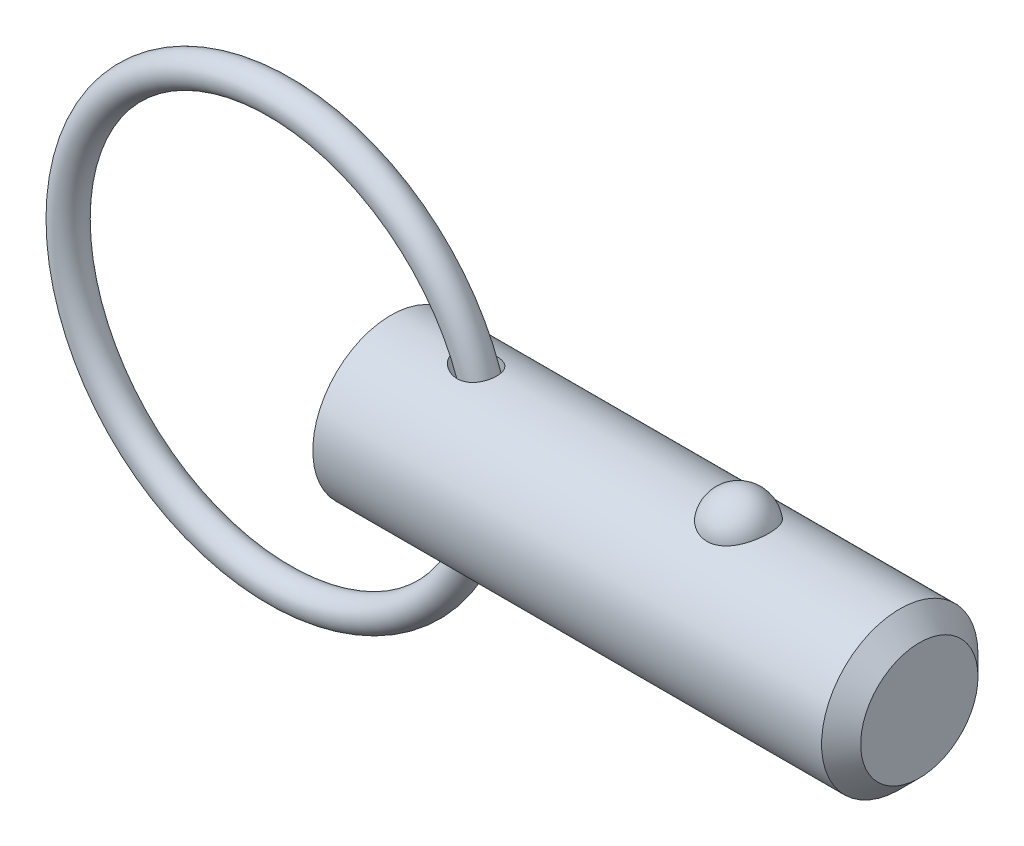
ISO-10303-21;
HEADER;
FILE_DESCRIPTION(('STEP AP214'),'2;1');
FILE_NAME('part.step','',(''),(''),'','','');
FILE_SCHEMA(('AUTOMOTIVE_DESIGN { 1 0 10303 214 1 1 1 1 }'));
ENDSEC;
DATA;
#1=APPLICATION_CONTEXT('core data for automotive mechanical design processes');
#2=APPLICATION_PROTOCOL_DEFINITION('international standard','automotive_design',2000,#1);
#3=PRODUCT_CONTEXT('',#1,'mechanical');
#4=PRODUCT('Part','Part','',(#3));
#5=PRODUCT_RELATED_PRODUCT_CATEGORY('part','',(#4));
#6=PRODUCT_DEFINITION_FORMATION('','',#4);
#7=PRODUCT_DEFINITION_CONTEXT('part definition',#1,'design');
#8=PRODUCT_DEFINITION('design','',#6,#7);
#9=PRODUCT_DEFINITION_SHAPE('','',#8);
#10=(LENGTH_UNIT() NAMED_UNIT(*) SI_UNIT(.MILLI.,.METRE.));
#11=(NAMED_UNIT(*) PLANE_ANGLE_UNIT() SI_UNIT($,.RADIAN.));
#12=(NAMED_UNIT(*) SI_UNIT($,.STERADIAN.) SOLID_ANGLE_UNIT());
#13=UNCERTAINTY_MEASURE_WITH_UNIT(LENGTH_MEASURE(1.E-05),#10,'distance_accuracy_value','');
#14=(GEOMETRIC_REPRESENTATION_CONTEXT(3) GLOBAL_UNCERTAINTY_ASSIGNED_CONTEXT((#13)) GLOBAL_UNIT_ASSIGNED_CONTEXT((#10,
#11,#12)) REPRESENTATION_CONTEXT('',''));
#15=CARTESIAN_POINT('',(0.,0.,0.));
#16=DIRECTION('',(0.,0.,1.));
#17=DIRECTION('',(1.,0.,0.));
#18=AXIS2_PLACEMENT_3D('',#15,#16,#17);
#19=CARTESIAN_POINT('',(-6.70471658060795,0.,0.));
#20=DIRECTION('',(0.,0.,1.));
#21=DIRECTION('',(1.,0.,0.));
#22=AXIS2_PLACEMENT_3D('',#19,#20,#21);
#23=TOROIDAL_SURFACE('',#22,12.7,0.940000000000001);
#24=CARTESIAN_POINT('',(6.93528341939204,0.,0.));
#25=VERTEX_POINT('',#24);
#26=VERTEX_LOOP('',#25);
#27=FACE_BOUND('',#26,.T.);
#28=ADVANCED_FACE('P0_F12',(#27),#23,.T.);
#29=CLOSED_SHELL('',(#28));
#30=MANIFOLD_SOLID_BREP('P0_B1',#29);
#31=CARTESIAN_POINT('',(0.,0.,0.));
#32=DIRECTION('',(1.,0.,0.));
#33=DIRECTION('',(0.,0.,-1.));
#34=AXIS2_PLACEMENT_3D('',#31,#32,#33);
#35=CYLINDRICAL_SURFACE('',#34,4.7);
#36=CARTESIAN_POINT('',(4.16378072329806,4.63584137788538,-0.773934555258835));
#37=CARTESIAN_POINT('',(4.22041228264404,4.62659903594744,-0.829297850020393));
#38=CARTESIAN_POINT('',(4.28206987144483,4.61719767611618,-0.87952289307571));
#39=CARTESIAN_POINT('',(4.41303152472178,4.59925351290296,-0.968997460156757));
#40=CARTESIAN_POINT('',(4.48234424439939,4.59071170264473,-1.00823437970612));
#41=CARTESIAN_POINT('',(4.62650734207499,4.57554939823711,-1.07495006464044));
#42=CARTESIAN_POINT('',(4.70135029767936,4.56892638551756,-1.10244426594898));
#43=CARTESIAN_POINT('',(4.85470490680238,4.55848940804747,-1.14483874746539));
#44=CARTESIAN_POINT('',(4.93321503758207,4.55467428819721,-1.15974420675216));
#45=CARTESIAN_POINT('',(5.09197970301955,4.55051176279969,-1.17597559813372));
#46=CARTESIAN_POINT('',(5.17223836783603,4.55017372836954,-1.17726483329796));
#47=CARTESIAN_POINT('',(5.33159446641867,4.55326696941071,-1.16524823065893));
#48=CARTESIAN_POINT('',(5.41069268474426,4.55669556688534,-1.15195276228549));
#49=CARTESIAN_POINT('',(5.55698758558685,4.56647801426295,-1.11249214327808));
#50=CARTESIAN_POINT('',(5.62458628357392,4.57250771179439,-1.08773548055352));
#51=CARTESIAN_POINT('',(5.7539770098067,4.58665356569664,-1.02644632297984));
#52=CARTESIAN_POINT('',(5.8157717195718,4.59476875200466,-0.989919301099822));
#53=CARTESIAN_POINT('',(5.92681484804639,4.61135052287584,-0.909391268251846));
#54=CARTESIAN_POINT('',(5.97666790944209,4.61973919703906,-0.866204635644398));
#55=CARTESIAN_POINT('',(6.06817854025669,4.63643253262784,-0.771868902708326));
#56=CARTESIAN_POINT('',(6.10983710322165,4.64473720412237,-0.720720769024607));
#57=CARTESIAN_POINT('',(6.18318089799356,4.660174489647,-0.61292816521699));
#58=CARTESIAN_POINT('',(6.21503150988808,4.66732544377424,-0.556398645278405));
#59=CARTESIAN_POINT('',(6.26900210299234,4.67985590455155,-0.438689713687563));
#60=CARTESIAN_POINT('',(6.29112194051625,4.68523538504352,-0.37751023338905));
#61=CARTESIAN_POINT('',(6.3252384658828,4.6936733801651,-0.251831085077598));
#62=CARTESIAN_POINT('',(6.33717189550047,4.69671737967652,-0.187313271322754));
#63=CARTESIAN_POINT('',(6.35042407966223,4.70010386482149,-0.057125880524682));
#64=CARTESIAN_POINT('',(6.3517424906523,4.70044626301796,0.00854373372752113));
#65=CARTESIAN_POINT('',(6.34371729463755,4.69838816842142,0.139481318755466));
#66=CARTESIAN_POINT('',(6.33432596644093,4.69597539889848,0.204746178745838));
#67=CARTESIAN_POINT('',(6.30500866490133,4.68864655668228,0.332720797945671));
#68=CARTESIAN_POINT('',(6.28508259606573,4.68373046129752,0.395430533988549));
#69=CARTESIAN_POINT('',(6.23516511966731,4.67193431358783,0.516455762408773));
#70=CARTESIAN_POINT('',(6.20518126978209,4.66505573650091,0.574774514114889));
#71=CARTESIAN_POINT('',(6.1358631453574,4.65009270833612,0.685387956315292));
#72=CARTESIAN_POINT('',(6.09652950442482,4.64200833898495,0.737683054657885));
#73=CARTESIAN_POINT('',(6.00979078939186,4.62559001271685,0.834455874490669));
#74=CARTESIAN_POINT('',(5.96243625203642,4.61725787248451,0.87897919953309));
#75=CARTESIAN_POINT('',(5.8607984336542,4.60122574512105,0.959378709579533));
#76=CARTESIAN_POINT('',(5.80651591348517,4.59352568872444,0.995255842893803));
#77=CARTESIAN_POINT('',(5.69277386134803,4.57961669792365,1.05741527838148));
#78=CARTESIAN_POINT('',(5.63333134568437,4.57340309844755,1.08372773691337));
#79=CARTESIAN_POINT('',(5.51084249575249,4.56305640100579,1.12650026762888));
#80=CARTESIAN_POINT('',(5.44779577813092,4.55892352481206,1.14295928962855));
#81=CARTESIAN_POINT('',(5.31795668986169,4.55299444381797,1.1663590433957));
#82=CARTESIAN_POINT('',(5.25110869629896,4.55127026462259,1.17300670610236));
#83=CARTESIAN_POINT('',(5.11716812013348,4.55043953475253,1.17622268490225));
#84=CARTESIAN_POINT('',(5.0500754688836,4.55133378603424,1.17278791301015));
#85=CARTESIAN_POINT('',(4.91166083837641,4.55569951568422,1.15571913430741));
#86=CARTESIAN_POINT('',(4.84044690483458,4.55937764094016,1.1412666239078));
#87=CARTESIAN_POINT('',(4.70108819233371,4.56903562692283,1.10196123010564));
#88=CARTESIAN_POINT('',(4.63294574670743,4.57501720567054,1.07710058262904));
#89=CARTESIAN_POINT('',(4.49477300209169,4.58927184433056,1.01474439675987));
#90=CARTESIAN_POINT('',(4.42520748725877,4.59771156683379,0.976252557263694));
#91=CARTESIAN_POINT('',(4.29354165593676,4.61552030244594,0.888246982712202));
#92=CARTESIAN_POINT('',(4.23143936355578,4.62488906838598,0.838736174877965));
#93=CARTESIAN_POINT('',(4.12609666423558,4.64192969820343,0.738015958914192));
#94=CARTESIAN_POINT('',(4.0814263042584,4.64963595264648,0.688308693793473));
#95=CARTESIAN_POINT('',(4.00081170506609,4.66411457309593,0.582144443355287));
#96=CARTESIAN_POINT('',(3.96485623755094,4.6708881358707,0.52569628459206));
#97=CARTESIAN_POINT('',(3.90818393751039,4.68183565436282,0.415917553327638));
#98=CARTESIAN_POINT('',(3.88599581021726,4.68624644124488,0.363372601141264));
#99=CARTESIAN_POINT('',(3.85055971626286,4.693376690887,0.25523059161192));
#100=CARTESIAN_POINT('',(3.83730635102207,4.69609717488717,0.199635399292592));
#101=CARTESIAN_POINT('',(3.82058225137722,4.69954043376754,0.0867104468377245));
#102=CARTESIAN_POINT('',(3.81714632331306,4.70025610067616,0.0293752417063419));
#103=CARTESIAN_POINT('',(3.8204140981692,4.69957935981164,-0.0849928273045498));
#104=CARTESIAN_POINT('',(3.82711802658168,4.69818690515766,-0.142025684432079));
#105=CARTESIAN_POINT('',(3.84950128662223,4.69360426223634,-0.250744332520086));
#106=CARTESIAN_POINT('',(3.8646389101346,4.69052274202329,-0.302548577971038));
#107=CARTESIAN_POINT('',(3.90261190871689,4.68295207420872,-0.403121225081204));
#108=CARTESIAN_POINT('',(3.92544863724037,4.67846267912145,-0.451889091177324));
#109=CARTESIAN_POINT('',(3.97999306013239,4.6680441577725,-0.549522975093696));
#110=CARTESIAN_POINT('',(4.01228648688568,4.66202553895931,-0.598050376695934));
#111=CARTESIAN_POINT('',(4.08340845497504,4.64931397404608,-0.68995446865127));
#112=CARTESIAN_POINT('',(4.12224260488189,4.64262045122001,-0.733326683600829));
#113=CARTESIAN_POINT('',(4.16378072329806,4.63584137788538,-0.773934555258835));
#114=B_SPLINE_CURVE_WITH_KNOTS('',3,(#36,#37,#38,#39,#40,#41,#42,#43,#44,#45,#46,#47,#48,#49,
#50,#51,#52,#53,#54,#55,#56,#57,#58,#59,#60,#61,#62,#63,#64,#65,#66,#67,#68,#69,#70,#71,#72,#73,
#74,#75,#76,#77,#78,#79,#80,#81,#82,#83,#84,#85,#86,#87,#88,#89,#90,#91,#92,#93,#94,#95,#96,#97,
#98,#99,#100,#101,#102,#103,#104,#105,#106,#107,#108,#109,#110,#111,#112,#113),.UNSPECIFIED.,
.T.,.F.,(4,2,2,2,2,2,2,2,2,2,2,2,2,2,2,2,2,2,2,2,2,2,2,2,2,2,2,2,2,2,2,2,2,2,2,2,2,2,4),(0.,
0.238977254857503,0.478227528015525,0.717162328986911,0.955998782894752,1.19547875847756,
1.43478857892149,1.65034375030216,1.86579883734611,2.06429861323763,2.2627743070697,
2.45769248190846,2.65261353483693,2.848736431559,3.04486567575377,3.24187227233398,
3.43888065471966,3.63574133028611,3.83258866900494,4.0282389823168,4.22386782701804,
4.41887441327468,4.61390177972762,4.81464443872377,5.01544858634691,5.23282834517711,
5.45037055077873,5.68914354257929,5.9278531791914,6.12887730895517,6.32964104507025,
6.50053592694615,6.67132745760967,6.84272375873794,7.01412387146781,7.17560768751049,
7.33711990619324,7.51225400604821,7.68753905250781),.UNSPECIFIED.);
#115=CARTESIAN_POINT('',(4.16378072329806,4.63584137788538,-0.773934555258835));
#116=VERTEX_POINT('',#115);
#117=EDGE_CURVE('P1_E40',#116,#116,#114,.T.);
#118=ORIENTED_EDGE('',*,*,#117,.T.);
#119=EDGE_LOOP('',(#118));
#120=FACE_BOUND('',#119,.T.);
#121=CARTESIAN_POINT('',(30.575,0.,0.));
#122=DIRECTION('',(1.,0.,0.));
#123=DIRECTION('',(0.,0.,-1.));
#124=AXIS2_PLACEMENT_3D('',#121,#122,#123);
#125=CIRCLE('',#124,4.7);
#126=CARTESIAN_POINT('',(30.575,0.,-4.7));
#127=VERTEX_POINT('',#126);
#128=EDGE_CURVE('P1_E25',#127,#127,#125,.T.);
#129=ORIENTED_EDGE('',*,*,#128,.F.);
#130=EDGE_LOOP('',(#129));
#131=FACE_BOUND('',#130,.T.);
#132=CARTESIAN_POINT('',(0.,0.,0.));
#133=DIRECTION('',(1.,0.,0.));
#134=DIRECTION('',(0.,0.,-1.));
#135=AXIS2_PLACEMENT_3D('',#132,#133,#134);
#136=CIRCLE('',#135,4.7);
#137=CARTESIAN_POINT('',(0.,0.,-4.7));
#138=VERTEX_POINT('',#137);
#139=EDGE_CURVE('P1_E9',#138,#138,#136,.T.);
#140=ORIENTED_EDGE('',*,*,#139,.T.);
#141=EDGE_LOOP('',(#140));
#142=FACE_BOUND('',#141,.T.);
#143=CARTESIAN_POINT('',(20.8806283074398,4.30387706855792,1.88855557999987));
#144=CARTESIAN_POINT('',(20.7828134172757,4.30388592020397,1.88854684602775));
#145=CARTESIAN_POINT('',(20.6848511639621,4.30731231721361,1.88078712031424));
#146=CARTESIAN_POINT('',(20.491662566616,4.32065009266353,1.84993192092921));
#147=CARTESIAN_POINT('',(20.3964438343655,4.33057798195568,1.82679740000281));
#148=CARTESIAN_POINT('',(20.2118175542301,4.3557457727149,1.76594245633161));
#149=CARTESIAN_POINT('',(20.1223953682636,4.37097162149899,1.72826059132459));
#150=CARTESIAN_POINT('',(19.9513907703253,4.4050778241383,1.6393730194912));
#151=CARTESIAN_POINT('',(19.869805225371,4.42395670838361,1.58817274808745));
#152=CARTESIAN_POINT('',(19.7139011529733,4.46404088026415,1.47181116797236));
#153=CARTESIAN_POINT('',(19.6398759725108,4.48529915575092,1.40627540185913));
#154=CARTESIAN_POINT('',(19.5035361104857,4.527485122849,1.26387806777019));
#155=CARTESIAN_POINT('',(19.4412249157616,4.54841271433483,1.18701313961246));
#156=CARTESIAN_POINT('',(19.3270723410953,4.58876216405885,1.02025841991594));
#157=CARTESIAN_POINT('',(19.2758113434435,4.60807744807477,0.929944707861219));
#158=CARTESIAN_POINT('',(19.1884245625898,4.6421320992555,0.741468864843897));
#159=CARTESIAN_POINT('',(19.1522995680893,4.65687122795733,0.643306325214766));
#160=CARTESIAN_POINT('',(19.0956718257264,4.68038485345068,0.440967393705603));
#161=CARTESIAN_POINT('',(19.0753048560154,4.68910744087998,0.336746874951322));
#162=CARTESIAN_POINT('',(19.0511323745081,4.69949255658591,0.126059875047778));
#163=CARTESIAN_POINT('',(19.0473260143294,4.70115544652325,0.0195935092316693));
#164=CARTESIAN_POINT('',(19.0563081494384,4.69727256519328,-0.191500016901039));
#165=CARTESIAN_POINT('',(19.0689415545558,4.69179416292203,-0.296135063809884));
#166=CARTESIAN_POINT('',(19.1102760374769,4.67429351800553,-0.501612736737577));
#167=CARTESIAN_POINT('',(19.1389773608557,4.66227117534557,-0.602455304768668));
#168=CARTESIAN_POINT('',(19.2119285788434,4.63286427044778,-0.797707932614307));
#169=CARTESIAN_POINT('',(19.2562044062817,4.61547077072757,-0.892106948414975));
#170=CARTESIAN_POINT('',(19.3594074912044,4.57709900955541,-1.07173134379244));
#171=CARTESIAN_POINT('',(19.4183362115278,4.55612039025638,-1.15695580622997));
#172=CARTESIAN_POINT('',(19.5502161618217,4.51257918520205,-1.31664252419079));
#173=CARTESIAN_POINT('',(19.6232867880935,4.49000423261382,-1.39100294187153));
#174=CARTESIAN_POINT('',(19.7814784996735,4.44594443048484,-1.52598548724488));
#175=CARTESIAN_POINT('',(19.8665990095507,4.42445952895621,-1.58660827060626));
#176=CARTESIAN_POINT('',(20.0452673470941,4.38543655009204,-1.69145998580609));
#177=CARTESIAN_POINT('',(20.1386518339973,4.36783887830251,-1.73594433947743));
#178=CARTESIAN_POINT('',(20.3324220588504,4.3382941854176,-1.80852276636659));
#179=CARTESIAN_POINT('',(20.4328051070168,4.32634500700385,-1.83662309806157));
#180=CARTESIAN_POINT('',(20.6322875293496,4.31005085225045,-1.87453136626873));
#181=CARTESIAN_POINT('',(20.7311967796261,4.30535309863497,-1.88518956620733));
#182=CARTESIAN_POINT('',(20.9295210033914,4.30299844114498,-1.89055986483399));
#183=CARTESIAN_POINT('',(21.0289358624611,4.30534000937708,-1.88527542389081));
#184=CARTESIAN_POINT('',(21.2218638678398,4.31657737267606,-1.85939299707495));
#185=CARTESIAN_POINT('',(21.3154624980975,4.32524571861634,-1.83932621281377));
#186=CARTESIAN_POINT('',(21.4977839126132,4.34791518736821,-1.7850744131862));
#187=CARTESIAN_POINT('',(21.5865063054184,4.36191673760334,-1.75088826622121));
#188=CARTESIAN_POINT('',(21.758694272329,4.39411605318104,-1.66845234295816));
#189=CARTESIAN_POINT('',(21.8420089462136,4.41239631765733,-1.61992036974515));
#190=CARTESIAN_POINT('',(21.999399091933,4.45109244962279,-1.51034589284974));
#191=CARTESIAN_POINT('',(22.0734723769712,4.47150882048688,-1.44930043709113));
#192=CARTESIAN_POINT('',(22.2144058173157,4.51353865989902,-1.31275193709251));
#193=CARTESIAN_POINT('',(22.2807014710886,4.53515983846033,-1.23666813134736));
#194=CARTESIAN_POINT('',(22.4000698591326,4.57635116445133,-1.07425533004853));
#195=CARTESIAN_POINT('',(22.4531402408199,4.59592094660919,-0.987924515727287));
#196=CARTESIAN_POINT('',(22.5464438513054,4.63161819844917,-0.804428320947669));
#197=CARTESIAN_POINT('',(22.5862298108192,4.64762063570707,-0.707010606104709));
#198=CARTESIAN_POINT('',(22.6498257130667,4.67374032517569,-0.506344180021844));
#199=CARTESIAN_POINT('',(22.6736358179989,4.68385763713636,-0.403095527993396));
#200=CARTESIAN_POINT('',(22.7047510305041,4.69716075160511,-0.193975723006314));
#201=CARTESIAN_POINT('',(22.7120987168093,4.70036443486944,-0.0881120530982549));
#202=CARTESIAN_POINT('',(22.7102611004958,4.6995691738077,0.123441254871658));
#203=CARTESIAN_POINT('',(22.7010764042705,4.69557049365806,0.2291308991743));
#204=CARTESIAN_POINT('',(22.6664922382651,4.68082941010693,0.436545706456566));
#205=CARTESIAN_POINT('',(22.641209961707,4.67013575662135,0.538293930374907));
#206=CARTESIAN_POINT('',(22.575050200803,4.64311776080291,0.735797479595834));
#207=CARTESIAN_POINT('',(22.534171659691,4.62679303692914,0.831552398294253));
#208=CARTESIAN_POINT('',(22.4372869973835,4.59002712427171,1.01512750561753));
#209=CARTESIAN_POINT('',(22.3811735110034,4.56955699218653,1.10288523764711));
#210=CARTESIAN_POINT('',(22.2551085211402,4.52671789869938,1.26730106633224));
#211=CARTESIAN_POINT('',(22.1851572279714,4.50434896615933,1.34395933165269));
#212=CARTESIAN_POINT('',(22.0327247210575,4.46008413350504,1.48428028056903));
#213=CARTESIAN_POINT('',(21.9502095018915,4.43818970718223,1.54790656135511));
#214=CARTESIAN_POINT('',(21.7747358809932,4.39746476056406,1.66008504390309));
#215=CARTESIAN_POINT('',(21.6817736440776,4.37863537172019,1.70863168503));
#216=CARTESIAN_POINT('',(21.4910997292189,4.34688784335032,1.78783023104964));
#217=CARTESIAN_POINT('',(21.3936298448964,4.33380220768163,1.81899757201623));
#218=CARTESIAN_POINT('',(21.1944052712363,4.31435159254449,1.86467392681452));
#219=CARTESIAN_POINT('',(21.0926639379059,4.30796708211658,1.87923136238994));
#220=CARTESIAN_POINT('',(20.9539136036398,4.3043503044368,1.8874737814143));
#221=CARTESIAN_POINT('',(20.9172813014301,4.30387375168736,1.8885588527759));
#222=CARTESIAN_POINT('',(20.8806283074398,4.30387706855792,1.88855557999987));
#223=B_SPLINE_CURVE_WITH_KNOTS('',3,(#143,#144,#145,#146,#147,#148,#149,#150,#151,#152,#153,
#154,#155,#156,#157,#158,#159,#160,#161,#162,#163,#164,#165,#166,#167,#168,#169,#170,#171,#172,
#173,#174,#175,#176,#177,#178,#179,#180,#181,#182,#183,#184,#185,#186,#187,#188,#189,#190,#191,
#192,#193,#194,#195,#196,#197,#198,#199,#200,#201,#202,#203,#204,#205,#206,#207,#208,#209,#210,
#211,#212,#213,#214,#215,#216,#217,#218,#219,#220,#221,#222),.UNSPECIFIED.,.T.,.F.,(4,2,2,2,2,2,
2,2,2,2,2,2,2,2,2,2,2,2,2,2,2,2,2,2,2,2,2,2,2,2,2,2,2,2,2,2,2,2,2,4),(0.,0.293339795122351,
0.587427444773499,0.880740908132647,1.17393661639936,1.47597417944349,1.77810150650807,
2.0935049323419,2.40892479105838,2.72703308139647,3.04512507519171,3.36023788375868,
3.67535550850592,3.9910003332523,4.30667668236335,4.62514463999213,4.94359739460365,
5.25676407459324,5.56981105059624,5.86708641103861,6.16429725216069,6.4513188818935,
6.73836351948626,7.03148013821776,7.3246659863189,7.63288296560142,7.94115473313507,
8.25895074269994,8.57674352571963,8.89371340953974,9.21067166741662,9.52534839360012,
9.84004644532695,10.157022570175,10.4739938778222,10.7918388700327,11.1098009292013,
11.4177488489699,11.7247967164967,11.834716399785),.UNSPECIFIED.);
#224=CARTESIAN_POINT('',(20.8806283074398,4.30387706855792,1.88855557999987));
#225=VERTEX_POINT('',#224);
#226=EDGE_CURVE('P1_E34',#225,#225,#223,.T.);
#227=ORIENTED_EDGE('',*,*,#226,.T.);
#228=EDGE_LOOP('',(#227));
#229=FACE_BOUND('',#228,.T.);
#230=CARTESIAN_POINT('',(4.16378072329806,-4.63584137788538,-0.773934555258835));
#231=CARTESIAN_POINT('',(4.11797605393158,-4.64331682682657,-0.72915472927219));
#232=CARTESIAN_POINT('',(4.07545237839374,-4.65068929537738,-0.681007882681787));
#233=CARTESIAN_POINT('',(3.99850919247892,-4.66454993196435,-0.578483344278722));
#234=CARTESIAN_POINT('',(3.96408464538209,-4.67103864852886,-0.52410955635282));
#235=CARTESIAN_POINT('',(3.90486465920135,-4.68247538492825,-0.409579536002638));
#236=CARTESIAN_POINT('',(3.88014787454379,-4.68741075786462,-0.349380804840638));
#237=CARTESIAN_POINT('',(3.84254060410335,-4.69500854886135,-0.225256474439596));
#238=CARTESIAN_POINT('',(3.82963753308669,-4.69767338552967,-0.161334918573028));
#239=CARTESIAN_POINT('',(3.81750619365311,-4.70018000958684,-0.0396774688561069));
#240=CARTESIAN_POINT('',(3.8168623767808,-4.70031401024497,0.0179134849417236));
#241=CARTESIAN_POINT('',(3.82570055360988,-4.69848615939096,0.13227097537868));
#242=CARTESIAN_POINT('',(3.83518142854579,-4.6965245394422,0.189037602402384));
#243=CARTESIAN_POINT('',(3.8627670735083,-4.69091189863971,0.296808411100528));
#244=CARTESIAN_POINT('',(3.88034293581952,-4.68736483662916,0.347956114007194));
#245=CARTESIAN_POINT('',(3.92293217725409,-4.67896699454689,0.446919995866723));
#246=CARTESIAN_POINT('',(3.94794743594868,-4.67411588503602,0.494735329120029));
#247=CARTESIAN_POINT('',(4.00723361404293,-4.66297432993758,0.590975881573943));
#248=CARTESIAN_POINT('',(4.04218787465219,-4.65658759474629,0.638966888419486));
#249=CARTESIAN_POINT('',(4.11850165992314,-4.64327412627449,0.729452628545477));
#250=CARTESIAN_POINT('',(4.15986486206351,-4.63634708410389,0.771944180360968));
#251=CARTESIAN_POINT('',(4.25563139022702,-4.62124878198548,0.858077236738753));
#252=CARTESIAN_POINT('',(4.31104724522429,-4.61307408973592,0.900593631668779));
#253=CARTESIAN_POINT('',(4.4276023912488,-4.59748077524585,0.977085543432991));
#254=CARTESIAN_POINT('',(4.48874590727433,-4.59006271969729,1.01105468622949));
#255=CARTESIAN_POINT('',(4.62409915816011,-4.5757760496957,1.07399161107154));
#256=CARTESIAN_POINT('',(4.69895162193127,-4.56912175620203,1.10163764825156));
#257=CARTESIAN_POINT('',(4.85238616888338,-4.55861611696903,1.14433682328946));
#258=CARTESIAN_POINT('',(4.93096882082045,-4.55476520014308,1.15938803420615));
#259=CARTESIAN_POINT('',(5.08983848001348,-4.55053674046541,1.17587995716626));
#260=CARTESIAN_POINT('',(5.17012835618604,-4.55016559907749,1.17729558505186));
#261=CARTESIAN_POINT('',(5.32956049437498,-4.55319561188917,1.16552635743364));
#262=CARTESIAN_POINT('',(5.40870366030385,-4.55659361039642,1.15235371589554));
#263=CARTESIAN_POINT('',(5.55512154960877,-4.56632591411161,1.11311448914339));
#264=CARTESIAN_POINT('',(5.62279525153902,-4.57233592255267,1.08845479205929));
#265=CARTESIAN_POINT('',(5.7523519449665,-4.58645252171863,1.02734156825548));
#266=CARTESIAN_POINT('',(5.81423750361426,-4.59455817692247,0.990893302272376));
#267=CARTESIAN_POINT('',(5.92544729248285,-4.61112960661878,0.910507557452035));
#268=CARTESIAN_POINT('',(5.9753775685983,-4.61951638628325,0.867388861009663));
#269=CARTESIAN_POINT('',(6.06705041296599,-4.63621447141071,0.773173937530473));
#270=CARTESIAN_POINT('',(6.10879399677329,-4.64452578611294,0.722078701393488));
#271=CARTESIAN_POINT('',(6.18230323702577,-4.65998194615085,0.614385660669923));
#272=CARTESIAN_POINT('',(6.21423602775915,-4.66714520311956,0.557904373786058));
#273=CARTESIAN_POINT('',(6.26837651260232,-4.67970630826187,0.440277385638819));
#274=CARTESIAN_POINT('',(6.29058407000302,-4.68510413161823,0.379131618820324));
#275=CARTESIAN_POINT('',(6.32487950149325,-4.69358284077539,0.253506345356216));
#276=CARTESIAN_POINT('',(6.33690441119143,-4.69664929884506,0.189008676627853));
#277=CARTESIAN_POINT('',(6.35034148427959,-4.70008248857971,0.0588455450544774));
#278=CARTESIAN_POINT('',(6.35175330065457,-4.70044913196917,-0.00681995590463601));
#279=CARTESIAN_POINT('',(6.34391515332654,-4.69843881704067,-0.137767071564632));
#280=CARTESIAN_POINT('',(6.33461722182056,-4.69604951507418,-0.203045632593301));
#281=CARTESIAN_POINT('',(6.30548404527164,-4.68876413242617,-0.331063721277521));
#282=CARTESIAN_POINT('',(6.28564870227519,-4.68386802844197,-0.393803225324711));
#283=CARTESIAN_POINT('',(6.23590713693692,-4.67210599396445,-0.514904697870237));
#284=CARTESIAN_POINT('',(6.20600824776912,-4.66524149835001,-0.573269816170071));
#285=CARTESIAN_POINT('',(6.13685224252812,-4.65029918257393,-0.683989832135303));
#286=CARTESIAN_POINT('',(6.09759575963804,-4.6422214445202,-0.736345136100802));
#287=CARTESIAN_POINT('',(6.01099960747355,-4.62580793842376,-0.833250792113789));
#288=CARTESIAN_POINT('',(5.963710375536,-4.61747403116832,-0.87784652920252));
#289=CARTESIAN_POINT('',(5.86219002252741,-4.60143050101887,-0.958399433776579));
#290=CARTESIAN_POINT('',(5.80795966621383,-4.59372080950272,-0.994357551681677));
#291=CARTESIAN_POINT('',(5.69431062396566,-4.57978661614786,-1.05668157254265));
#292=CARTESIAN_POINT('',(5.63490936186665,-4.57355737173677,-1.08307825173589));
#293=CARTESIAN_POINT('',(5.51248756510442,-4.56317492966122,-1.12602176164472));
#294=CARTESIAN_POINT('',(5.44946662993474,-4.55902196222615,-1.1425675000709));
#295=CARTESIAN_POINT('',(5.3196775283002,-4.55305083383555,-1.16613984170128));
#296=CARTESIAN_POINT('',(5.25285368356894,-4.55130415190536,-1.17287534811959));
#297=CARTESIAN_POINT('',(5.11894995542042,-4.55042807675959,-1.17626714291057));
#298=CARTESIAN_POINT('',(5.05187000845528,-4.55129938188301,-1.17292074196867));
#299=CARTESIAN_POINT('',(4.91348721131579,-4.55561850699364,-1.15603764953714));
#300=CARTESIAN_POINT('',(4.84229084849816,-4.55927235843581,-1.14168541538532));
#301=CARTESIAN_POINT('',(4.70293860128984,-4.56888540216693,-1.10258192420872));
#302=CARTESIAN_POINT('',(4.63478566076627,-4.57484677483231,-1.07782082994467));
#303=CARTESIAN_POINT('',(4.49401200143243,-4.58932889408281,-1.01452290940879));
#304=CARTESIAN_POINT('',(4.42204931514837,-4.59808779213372,-0.974568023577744));
#305=CARTESIAN_POINT('',(4.28620227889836,-4.61656806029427,-0.882881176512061));
#306=CARTESIAN_POINT('',(4.22231268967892,-4.62628879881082,-0.831156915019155));
#307=CARTESIAN_POINT('',(4.16378072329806,-4.63584137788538,-0.773934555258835));
#308=B_SPLINE_CURVE_WITH_KNOTS('',3,(#230,#231,#232,#233,#234,#235,#236,#237,#238,#239,#240,
#241,#242,#243,#244,#245,#246,#247,#248,#249,#250,#251,#252,#253,#254,#255,#256,#257,#258,#259,
#260,#261,#262,#263,#264,#265,#266,#267,#268,#269,#270,#271,#272,#273,#274,#275,#276,#277,#278,
#279,#280,#281,#282,#283,#284,#285,#286,#287,#288,#289,#290,#291,#292,#293,#294,#295,#296,#297,
#298,#299,#300,#301,#302,#303,#304,#305,#306,#307),.UNSPECIFIED.,.T.,.F.,(4,2,2,2,2,2,2,2,2,2,2,
2,2,2,2,2,2,2,2,2,2,2,2,2,2,2,2,2,2,2,2,2,2,2,2,2,2,2,4),(0.,0.193263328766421,
0.386406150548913,0.5810830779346,0.775552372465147,0.947410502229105,1.11924964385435,
1.28117818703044,1.44314767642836,1.62161944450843,1.80019400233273,2.01034324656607,
2.22064874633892,2.45975127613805,2.69889038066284,2.93846932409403,3.17784783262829,
3.39350806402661,3.60907218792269,3.8076122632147,4.00612769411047,4.20104508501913,
4.39596521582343,4.59208201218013,4.78820522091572,4.98521027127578,5.18221715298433,
5.37908078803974,5.57593110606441,5.7715882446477,5.96722384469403,6.1622240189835,
6.35724581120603,6.55794420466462,6.75869613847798,6.97596054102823,7.1934307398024,
7.44055547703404,7.68751900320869),.UNSPECIFIED.);
#309=CARTESIAN_POINT('',(4.16378072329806,-4.63584137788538,-0.773934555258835));
#310=VERTEX_POINT('',#309);
#311=EDGE_CURVE('P1_E17',#310,#310,#308,.T.);
#312=ORIENTED_EDGE('',*,*,#311,.T.);
#313=EDGE_LOOP('',(#312));
#314=FACE_BOUND('',#313,.T.);
#315=ADVANCED_FACE('P1_F13',(#120,#131,#142,#229,#314),#35,.T.);
#316=CARTESIAN_POINT('',(0.,0.,0.));
#317=DIRECTION('',(-1.,0.,0.));
#318=DIRECTION('',(0.,0.,1.));
#319=AXIS2_PLACEMENT_3D('',#316,#317,#318);
#320=PLANE('',#319);
#321=ORIENTED_EDGE('',*,*,#139,.F.);
#322=EDGE_LOOP('',(#321));
#323=FACE_BOUND('',#322,.T.);
#324=ADVANCED_FACE('P1_F15',(#323),#320,.T.);
#325=CARTESIAN_POINT('',(31.75,0.,0.));
#326=DIRECTION('',(-1.,0.,0.));
#327=DIRECTION('',(0.,0.,1.));
#328=AXIS2_PLACEMENT_3D('',#325,#326,#327);
#329=CONICAL_SURFACE('',#328,3.525,0.785398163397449);
#330=ORIENTED_EDGE('',*,*,#128,.T.);
#331=EDGE_LOOP('',(#330));
#332=FACE_BOUND('',#331,.T.);
#333=CARTESIAN_POINT('',(31.75,0.,0.));
#334=DIRECTION('',(1.,0.,0.));
#335=DIRECTION('',(0.,0.,-1.));
#336=AXIS2_PLACEMENT_3D('',#333,#334,#335);
#337=CIRCLE('',#336,3.525);
#338=CARTESIAN_POINT('',(31.75,0.,-3.525));
#339=VERTEX_POINT('',#338);
#340=EDGE_CURVE('P1_E30',#339,#339,#337,.T.);
#341=ORIENTED_EDGE('',*,*,#340,.F.);
#342=EDGE_LOOP('',(#341));
#343=FACE_BOUND('',#342,.T.);
#344=ADVANCED_FACE('P1_F55',(#332,#343),#329,.T.);
#345=CARTESIAN_POINT('',(31.75,3.525,0.));
#346=DIRECTION('',(1.,0.,0.));
#347=DIRECTION('',(0.,0.,-1.));
#348=AXIS2_PLACEMENT_3D('',#345,#346,#347);
#349=PLANE('',#348);
#350=ORIENTED_EDGE('',*,*,#340,.T.);
#351=EDGE_LOOP('',(#350));
#352=FACE_BOUND('',#351,.T.);
#353=ADVANCED_FACE('P1_F51',(#352),#349,.T.);
#354=CARTESIAN_POINT('',(20.8806283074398,4.23,0.));
#355=DIRECTION('',(-1.,0.,0.));
#356=DIRECTION('',(0.,1.,0.));
#357=AXIS2_PLACEMENT_3D('',#354,#355,#356);
#358=SPHERICAL_SURFACE('',#357,1.89);
#359=ORIENTED_EDGE('',*,*,#226,.F.);
#360=EDGE_LOOP('',(#359));
#361=FACE_BOUND('',#360,.T.);
#362=ADVANCED_FACE('P1_F46',(#361),#358,.T.);
#363=CARTESIAN_POINT('',(-6.70471658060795,0.,0.));
#364=DIRECTION('',(0.,0.,1.));
#365=DIRECTION('',(1.,0.,0.));
#366=AXIS2_PLACEMENT_3D('',#363,#364,#365);
#367=TOROIDAL_SURFACE('',#366,12.7,1.175);
#368=ORIENTED_EDGE('',*,*,#311,.F.);
#369=EDGE_LOOP('',(#368));
#370=FACE_BOUND('',#369,.T.);
#371=ORIENTED_EDGE('',*,*,#117,.F.);
#372=EDGE_LOOP('',(#371));
#373=FACE_BOUND('',#372,.T.);
#374=ADVANCED_FACE('P1_F50',(#370,#373),#367,.F.);
#375=CLOSED_SHELL('',(#315,#324,#344,#353,#362,#374));
#376=MANIFOLD_SOLID_BREP('P1_B1',#375);
#377=ADVANCED_BREP_SHAPE_REPRESENTATION('',(#18,#30,#376),#14);
#378=SHAPE_DEFINITION_REPRESENTATION(#9,#377);
ENDSEC;
END-ISO-10303-21;
